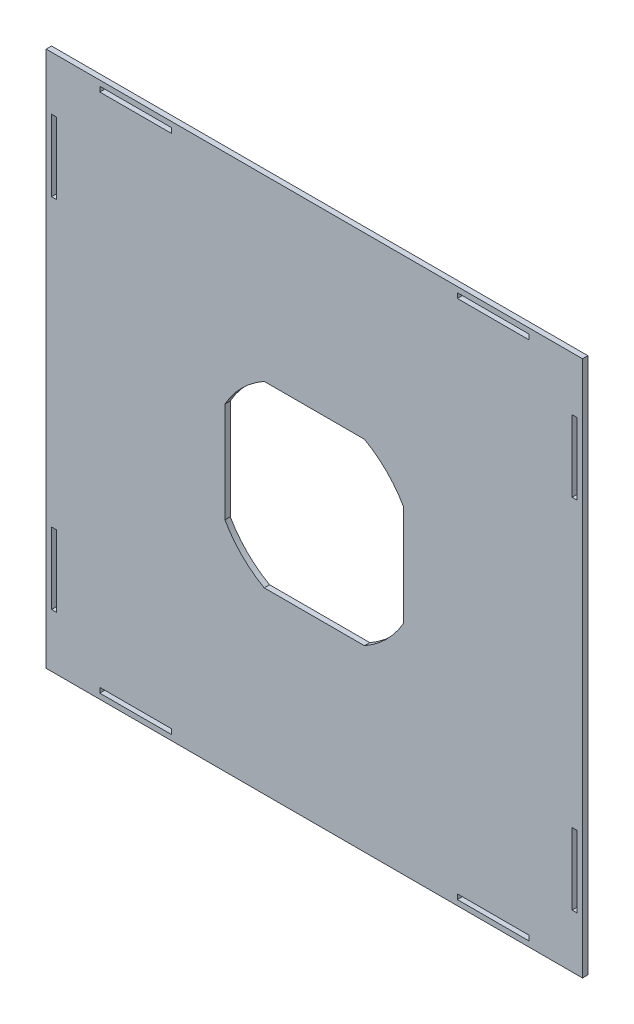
ISO-10303-21;
HEADER;
FILE_DESCRIPTION(('STEP AP214'),'2;1');
FILE_NAME('part.step','',(''),(''),'','','');
FILE_SCHEMA(('AUTOMOTIVE_DESIGN { 1 0 10303 214 1 1 1 1 }'));
ENDSEC;
DATA;
#1=APPLICATION_CONTEXT('core data for automotive mechanical design processes');
#2=APPLICATION_PROTOCOL_DEFINITION('international standard','automotive_design',2000,#1);
#3=PRODUCT_CONTEXT('',#1,'mechanical');
#4=PRODUCT('Part','Part','',(#3));
#5=PRODUCT_RELATED_PRODUCT_CATEGORY('part','',(#4));
#6=PRODUCT_DEFINITION_FORMATION('','',#4);
#7=PRODUCT_DEFINITION_CONTEXT('part definition',#1,'design');
#8=PRODUCT_DEFINITION('design','',#6,#7);
#9=PRODUCT_DEFINITION_SHAPE('','',#8);
#10=(LENGTH_UNIT() NAMED_UNIT(*) SI_UNIT(.MILLI.,.METRE.));
#11=(NAMED_UNIT(*) PLANE_ANGLE_UNIT() SI_UNIT($,.RADIAN.));
#12=(NAMED_UNIT(*) SI_UNIT($,.STERADIAN.) SOLID_ANGLE_UNIT());
#13=UNCERTAINTY_MEASURE_WITH_UNIT(LENGTH_MEASURE(1.E-05),#10,'distance_accuracy_value','');
#14=(GEOMETRIC_REPRESENTATION_CONTEXT(3) GLOBAL_UNCERTAINTY_ASSIGNED_CONTEXT((#13)) GLOBAL_UNIT_ASSIGNED_CONTEXT((#10,
#11,#12)) REPRESENTATION_CONTEXT('',''));
#15=CARTESIAN_POINT('',(0.,0.,0.));
#16=DIRECTION('',(0.,0.,1.));
#17=DIRECTION('',(1.,0.,0.));
#18=AXIS2_PLACEMENT_3D('',#15,#16,#17);
#19=CARTESIAN_POINT('',(0.,0.,3.));
#20=DIRECTION('',(0.,0.,-1.));
#21=DIRECTION('',(-1.,0.,0.));
#22=AXIS2_PLACEMENT_3D('',#19,#20,#21);
#23=PLANE('',#22);
#24=DIRECTION('',(-1.,0.,0.));
#25=VECTOR('',#24,1.);
#26=CARTESIAN_POINT('',(-28.0435023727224,50.0000000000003,3.));
#27=LINE('',#26,#25);
#28=CARTESIAN_POINT('',(28.0435023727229,50.,3.));
#29=VERTEX_POINT('',#28);
#30=CARTESIAN_POINT('',(-28.0435023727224,50.0000000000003,3.));
#31=VERTEX_POINT('',#30);
#32=EDGE_CURVE('E325',#29,#31,#27,.T.);
#33=ORIENTED_EDGE('',*,*,#32,.F.);
#34=CARTESIAN_POINT('',(0.,0.,3.));
#35=DIRECTION('',(0.,0.,1.));
#36=DIRECTION('',(-1.,0.,0.));
#37=AXIS2_PLACEMENT_3D('',#34,#35,#36);
#38=CIRCLE('',#37,57.327463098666);
#39=CARTESIAN_POINT('',(50.,28.0435023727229,3.));
#40=VERTEX_POINT('',#39);
#41=EDGE_CURVE('E48',#40,#29,#38,.T.);
#42=ORIENTED_EDGE('',*,*,#41,.F.);
#43=DIRECTION('',(0.,1.,0.));
#44=VECTOR('',#43,1.);
#45=CARTESIAN_POINT('',(49.9999999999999,-28.0435023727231,3.));
#46=LINE('',#45,#44);
#47=CARTESIAN_POINT('',(49.9999999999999,-28.0435023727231,3.));
#48=VERTEX_POINT('',#47);
#49=EDGE_CURVE('E346',#48,#40,#46,.T.);
#50=ORIENTED_EDGE('',*,*,#49,.F.);
#51=CARTESIAN_POINT('',(0.,0.,3.));
#52=DIRECTION('',(0.,0.,1.));
#53=DIRECTION('',(-1.,0.,0.));
#54=AXIS2_PLACEMENT_3D('',#51,#52,#53);
#55=CIRCLE('',#54,57.327463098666);
#56=CARTESIAN_POINT('',(28.0435023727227,-50.0000000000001,3.));
#57=VERTEX_POINT('',#56);
#58=EDGE_CURVE('E343',#57,#48,#55,.T.);
#59=ORIENTED_EDGE('',*,*,#58,.F.);
#60=DIRECTION('',(1.,0.,0.));
#61=VECTOR('',#60,1.);
#62=CARTESIAN_POINT('',(-28.0435023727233,-49.9999999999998,3.));
#63=LINE('',#62,#61);
#64=CARTESIAN_POINT('',(-28.0435023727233,-49.9999999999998,3.));
#65=VERTEX_POINT('',#64);
#66=EDGE_CURVE('E340',#65,#57,#63,.T.);
#67=ORIENTED_EDGE('',*,*,#66,.F.);
#68=CARTESIAN_POINT('',(0.,0.,3.));
#69=DIRECTION('',(0.,0.,1.));
#70=DIRECTION('',(-1.,0.,0.));
#71=AXIS2_PLACEMENT_3D('',#68,#69,#70);
#72=CIRCLE('',#71,57.327463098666);
#73=CARTESIAN_POINT('',(-50.0000000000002,-28.0435023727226,3.));
#74=VERTEX_POINT('',#73);
#75=EDGE_CURVE('E334',#74,#65,#72,.T.);
#76=ORIENTED_EDGE('',*,*,#75,.F.);
#77=DIRECTION('',(0.,-1.,0.));
#78=VECTOR('',#77,1.);
#79=CARTESIAN_POINT('',(-50.0000000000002,-28.0435023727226,3.));
#80=LINE('',#79,#78);
#81=CARTESIAN_POINT('',(-49.9999999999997,28.0435023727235,3.));
#82=VERTEX_POINT('',#81);
#83=EDGE_CURVE('E332',#82,#74,#80,.T.);
#84=ORIENTED_EDGE('',*,*,#83,.F.);
#85=CARTESIAN_POINT('',(0.,0.,3.));
#86=DIRECTION('',(0.,0.,1.));
#87=DIRECTION('',(-1.,0.,0.));
#88=AXIS2_PLACEMENT_3D('',#85,#86,#87);
#89=CIRCLE('',#88,57.327463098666);
#90=EDGE_CURVE('E316',#31,#82,#89,.T.);
#91=ORIENTED_EDGE('',*,*,#90,.F.);
#92=EDGE_LOOP('',(#33,#42,#50,#59,#67,#76,#84,#91));
#93=FACE_BOUND('',#92,.T.);
#94=DIRECTION('',(0.,-1.,0.));
#95=VECTOR('',#94,1.);
#96=CARTESIAN_POINT('',(144.199999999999,-120.000000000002,3.));
#97=LINE('',#96,#95);
#98=CARTESIAN_POINT('',(144.199999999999,-80.0000000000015,3.));
#99=VERTEX_POINT('',#98);
#100=CARTESIAN_POINT('',(144.199999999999,-120.000000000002,3.));
#101=VERTEX_POINT('',#100);
#102=EDGE_CURVE('E393',#99,#101,#97,.T.);
#103=ORIENTED_EDGE('',*,*,#102,.F.);
#104=DIRECTION('',(-1.,0.,0.));
#105=VECTOR('',#104,1.);
#106=CARTESIAN_POINT('',(144.199999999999,-80.0000000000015,3.));
#107=LINE('',#106,#105);
#108=CARTESIAN_POINT('',(146.999999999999,-80.0000000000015,3.));
#109=VERTEX_POINT('',#108);
#110=EDGE_CURVE('E401',#109,#99,#107,.T.);
#111=ORIENTED_EDGE('',*,*,#110,.F.);
#112=DIRECTION('',(0.,1.,0.));
#113=VECTOR('',#112,1.);
#114=CARTESIAN_POINT('',(146.999999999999,-120.000000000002,3.));
#115=LINE('',#114,#113);
#116=CARTESIAN_POINT('',(146.999999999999,-120.000000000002,3.));
#117=VERTEX_POINT('',#116);
#118=EDGE_CURVE('E398',#117,#109,#115,.T.);
#119=ORIENTED_EDGE('',*,*,#118,.F.);
#120=DIRECTION('',(1.,0.,0.));
#121=VECTOR('',#120,1.);
#122=CARTESIAN_POINT('',(144.199999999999,-120.000000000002,3.));
#123=LINE('',#122,#121);
#124=EDGE_CURVE('E395',#101,#117,#123,.T.);
#125=ORIENTED_EDGE('',*,*,#124,.F.);
#126=EDGE_LOOP('',(#103,#111,#119,#125));
#127=FACE_BOUND('',#126,.T.);
#128=DIRECTION('',(1.,0.,0.));
#129=VECTOR('',#128,1.);
#130=CARTESIAN_POINT('',(120.000000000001,144.199999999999,3.));
#131=LINE('',#130,#129);
#132=CARTESIAN_POINT('',(80.000000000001,144.199999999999,3.));
#133=VERTEX_POINT('',#132);
#134=CARTESIAN_POINT('',(120.000000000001,144.199999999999,3.));
#135=VERTEX_POINT('',#134);
#136=EDGE_CURVE('E455',#133,#135,#131,.T.);
#137=ORIENTED_EDGE('',*,*,#136,.F.);
#138=DIRECTION('',(0.,-1.,0.));
#139=VECTOR('',#138,1.);
#140=CARTESIAN_POINT('',(80.000000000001,144.199999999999,3.));
#141=LINE('',#140,#139);
#142=CARTESIAN_POINT('',(80.000000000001,146.999999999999,3.));
#143=VERTEX_POINT('',#142);
#144=EDGE_CURVE('E463',#143,#133,#141,.T.);
#145=ORIENTED_EDGE('',*,*,#144,.F.);
#146=DIRECTION('',(-1.,0.,0.));
#147=VECTOR('',#146,1.);
#148=CARTESIAN_POINT('',(120.000000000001,146.999999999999,3.));
#149=LINE('',#148,#147);
#150=CARTESIAN_POINT('',(120.000000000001,146.999999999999,3.));
#151=VERTEX_POINT('',#150);
#152=EDGE_CURVE('E460',#151,#143,#149,.T.);
#153=ORIENTED_EDGE('',*,*,#152,.F.);
#154=DIRECTION('',(0.,1.,0.));
#155=VECTOR('',#154,1.);
#156=CARTESIAN_POINT('',(120.000000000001,144.199999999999,3.));
#157=LINE('',#156,#155);
#158=EDGE_CURVE('E457',#135,#151,#157,.T.);
#159=ORIENTED_EDGE('',*,*,#158,.F.);
#160=EDGE_LOOP('',(#137,#145,#153,#159));
#161=FACE_BOUND('',#160,.T.);
#162=DIRECTION('',(0.,1.,0.));
#163=VECTOR('',#162,1.);
#164=CARTESIAN_POINT('',(-144.2,120.,3.));
#165=LINE('',#164,#163);
#166=CARTESIAN_POINT('',(-144.2,80.0000000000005,3.));
#167=VERTEX_POINT('',#166);
#168=CARTESIAN_POINT('',(-144.2,120.,3.));
#169=VERTEX_POINT('',#168);
#170=EDGE_CURVE('E517',#167,#169,#165,.T.);
#171=ORIENTED_EDGE('',*,*,#170,.F.);
#172=DIRECTION('',(1.,0.,0.));
#173=VECTOR('',#172,1.);
#174=CARTESIAN_POINT('',(-144.2,80.0000000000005,3.));
#175=LINE('',#174,#173);
#176=CARTESIAN_POINT('',(-147.,80.0000000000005,3.));
#177=VERTEX_POINT('',#176);
#178=EDGE_CURVE('E525',#177,#167,#175,.T.);
#179=ORIENTED_EDGE('',*,*,#178,.F.);
#180=DIRECTION('',(0.,-1.,0.));
#181=VECTOR('',#180,1.);
#182=CARTESIAN_POINT('',(-147.,120.,3.));
#183=LINE('',#182,#181);
#184=CARTESIAN_POINT('',(-147.,120.,3.));
#185=VERTEX_POINT('',#184);
#186=EDGE_CURVE('E522',#185,#177,#183,.T.);
#187=ORIENTED_EDGE('',*,*,#186,.F.);
#188=DIRECTION('',(-1.,0.,0.));
#189=VECTOR('',#188,1.);
#190=CARTESIAN_POINT('',(-144.2,120.,3.));
#191=LINE('',#190,#189);
#192=EDGE_CURVE('E519',#169,#185,#191,.T.);
#193=ORIENTED_EDGE('',*,*,#192,.F.);
#194=EDGE_LOOP('',(#171,#179,#187,#193));
#195=FACE_BOUND('',#194,.T.);
#196=DIRECTION('',(0.,-1.,0.));
#197=VECTOR('',#196,1.);
#198=CARTESIAN_POINT('',(-120.,-144.2,3.));
#199=LINE('',#198,#197);
#200=CARTESIAN_POINT('',(-120.,-144.2,3.));
#201=VERTEX_POINT('',#200);
#202=CARTESIAN_POINT('',(-120.,-147.,3.));
#203=VERTEX_POINT('',#202);
#204=EDGE_CURVE('E579',#201,#203,#199,.T.);
#205=ORIENTED_EDGE('',*,*,#204,.F.);
#206=DIRECTION('',(-1.,0.,0.));
#207=VECTOR('',#206,1.);
#208=CARTESIAN_POINT('',(-120.,-144.2,3.));
#209=LINE('',#208,#207);
#210=CARTESIAN_POINT('',(-80.,-144.2,3.));
#211=VERTEX_POINT('',#210);
#212=EDGE_CURVE('E587',#211,#201,#209,.T.);
#213=ORIENTED_EDGE('',*,*,#212,.F.);
#214=DIRECTION('',(0.,1.,0.));
#215=VECTOR('',#214,1.);
#216=CARTESIAN_POINT('',(-80.,-144.2,3.));
#217=LINE('',#216,#215);
#218=CARTESIAN_POINT('',(-80.,-147.,3.));
#219=VERTEX_POINT('',#218);
#220=EDGE_CURVE('E584',#219,#211,#217,.T.);
#221=ORIENTED_EDGE('',*,*,#220,.F.);
#222=DIRECTION('',(1.,0.,0.));
#223=VECTOR('',#222,1.);
#224=CARTESIAN_POINT('',(-120.,-147.,3.));
#225=LINE('',#224,#223);
#226=EDGE_CURVE('E581',#203,#219,#225,.T.);
#227=ORIENTED_EDGE('',*,*,#226,.F.);
#228=EDGE_LOOP('',(#205,#213,#221,#227));
#229=FACE_BOUND('',#228,.T.);
#230=DIRECTION('',(0.,1.,0.));
#231=VECTOR('',#230,1.);
#232=CARTESIAN_POINT('',(150.,-150.,3.));
#233=LINE('',#232,#231);
#234=CARTESIAN_POINT('',(150.,-150.,3.));
#235=VERTEX_POINT('',#234);
#236=CARTESIAN_POINT('',(150.,150.,3.));
#237=VERTEX_POINT('',#236);
#238=EDGE_CURVE('E610',#235,#237,#233,.T.);
#239=ORIENTED_EDGE('',*,*,#238,.T.);
#240=DIRECTION('',(-1.,0.,0.));
#241=VECTOR('',#240,1.);
#242=CARTESIAN_POINT('',(-150.,150.,3.));
#243=LINE('',#242,#241);
#244=CARTESIAN_POINT('',(-150.,150.,3.));
#245=VERTEX_POINT('',#244);
#246=EDGE_CURVE('E613',#237,#245,#243,.T.);
#247=ORIENTED_EDGE('',*,*,#246,.T.);
#248=DIRECTION('',(0.,-1.,0.));
#249=VECTOR('',#248,1.);
#250=CARTESIAN_POINT('',(-150.,-150.,3.));
#251=LINE('',#250,#249);
#252=CARTESIAN_POINT('',(-150.,-150.,3.));
#253=VERTEX_POINT('',#252);
#254=EDGE_CURVE('E616',#245,#253,#251,.T.);
#255=ORIENTED_EDGE('',*,*,#254,.T.);
#256=DIRECTION('',(1.,0.,0.));
#257=VECTOR('',#256,1.);
#258=CARTESIAN_POINT('',(-150.,-150.,3.));
#259=LINE('',#258,#257);
#260=EDGE_CURVE('E618',#253,#235,#259,.T.);
#261=ORIENTED_EDGE('',*,*,#260,.T.);
#262=EDGE_LOOP('',(#239,#247,#255,#261));
#263=FACE_BOUND('',#262,.T.);
#264=DIRECTION('',(0.,1.,0.));
#265=VECTOR('',#264,1.);
#266=CARTESIAN_POINT('',(120.,-144.2,3.));
#267=LINE('',#266,#265);
#268=CARTESIAN_POINT('',(120.,-147.,3.));
#269=VERTEX_POINT('',#268);
#270=CARTESIAN_POINT('',(120.,-144.2,3.));
#271=VERTEX_POINT('',#270);
#272=EDGE_CURVE('E548',#269,#271,#267,.T.);
#273=ORIENTED_EDGE('',*,*,#272,.F.);
#274=DIRECTION('',(1.,0.,0.));
#275=VECTOR('',#274,1.);
#276=CARTESIAN_POINT('',(120.,-147.,3.));
#277=LINE('',#276,#275);
#278=CARTESIAN_POINT('',(80.,-147.,3.));
#279=VERTEX_POINT('',#278);
#280=EDGE_CURVE('E556',#279,#269,#277,.T.);
#281=ORIENTED_EDGE('',*,*,#280,.F.);
#282=DIRECTION('',(0.,-1.,0.));
#283=VECTOR('',#282,1.);
#284=CARTESIAN_POINT('',(80.,-144.2,3.));
#285=LINE('',#284,#283);
#286=CARTESIAN_POINT('',(80.,-144.2,3.));
#287=VERTEX_POINT('',#286);
#288=EDGE_CURVE('E553',#287,#279,#285,.T.);
#289=ORIENTED_EDGE('',*,*,#288,.F.);
#290=DIRECTION('',(-1.,0.,0.));
#291=VECTOR('',#290,1.);
#292=CARTESIAN_POINT('',(120.,-144.2,3.));
#293=LINE('',#292,#291);
#294=EDGE_CURVE('E550',#271,#287,#293,.T.);
#295=ORIENTED_EDGE('',*,*,#294,.F.);
#296=EDGE_LOOP('',(#273,#281,#289,#295));
#297=FACE_BOUND('',#296,.T.);
#298=DIRECTION('',(1.,0.,0.));
#299=VECTOR('',#298,1.);
#300=CARTESIAN_POINT('',(-144.2,-120.,3.));
#301=LINE('',#300,#299);
#302=CARTESIAN_POINT('',(-147.,-120.,3.));
#303=VERTEX_POINT('',#302);
#304=CARTESIAN_POINT('',(-144.2,-120.,3.));
#305=VERTEX_POINT('',#304);
#306=EDGE_CURVE('E486',#303,#305,#301,.T.);
#307=ORIENTED_EDGE('',*,*,#306,.F.);
#308=DIRECTION('',(0.,-1.,0.));
#309=VECTOR('',#308,1.);
#310=CARTESIAN_POINT('',(-147.,-120.,3.));
#311=LINE('',#310,#309);
#312=CARTESIAN_POINT('',(-147.,-79.9999999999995,3.));
#313=VERTEX_POINT('',#312);
#314=EDGE_CURVE('E494',#313,#303,#311,.T.);
#315=ORIENTED_EDGE('',*,*,#314,.F.);
#316=DIRECTION('',(-1.,0.,0.));
#317=VECTOR('',#316,1.);
#318=CARTESIAN_POINT('',(-144.2,-79.9999999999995,3.));
#319=LINE('',#318,#317);
#320=CARTESIAN_POINT('',(-144.2,-79.9999999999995,3.));
#321=VERTEX_POINT('',#320);
#322=EDGE_CURVE('E491',#321,#313,#319,.T.);
#323=ORIENTED_EDGE('',*,*,#322,.F.);
#324=DIRECTION('',(0.,1.,0.));
#325=VECTOR('',#324,1.);
#326=CARTESIAN_POINT('',(-144.2,-120.,3.));
#327=LINE('',#326,#325);
#328=EDGE_CURVE('E488',#305,#321,#327,.T.);
#329=ORIENTED_EDGE('',*,*,#328,.F.);
#330=EDGE_LOOP('',(#307,#315,#323,#329));
#331=FACE_BOUND('',#330,.T.);
#332=DIRECTION('',(0.,-1.,0.));
#333=VECTOR('',#332,1.);
#334=CARTESIAN_POINT('',(-119.999999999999,144.200000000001,3.));
#335=LINE('',#334,#333);
#336=CARTESIAN_POINT('',(-119.999999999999,147.000000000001,3.));
#337=VERTEX_POINT('',#336);
#338=CARTESIAN_POINT('',(-119.999999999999,144.200000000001,3.));
#339=VERTEX_POINT('',#338);
#340=EDGE_CURVE('E424',#337,#339,#335,.T.);
#341=ORIENTED_EDGE('',*,*,#340,.F.);
#342=DIRECTION('',(-1.,0.,0.));
#343=VECTOR('',#342,1.);
#344=CARTESIAN_POINT('',(-119.999999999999,147.000000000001,3.));
#345=LINE('',#344,#343);
#346=CARTESIAN_POINT('',(-79.999999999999,147.000000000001,3.));
#347=VERTEX_POINT('',#346);
#348=EDGE_CURVE('E432',#347,#337,#345,.T.);
#349=ORIENTED_EDGE('',*,*,#348,.F.);
#350=DIRECTION('',(0.,1.,0.));
#351=VECTOR('',#350,1.);
#352=CARTESIAN_POINT('',(-79.999999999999,144.200000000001,3.));
#353=LINE('',#352,#351);
#354=CARTESIAN_POINT('',(-79.999999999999,144.200000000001,3.));
#355=VERTEX_POINT('',#354);
#356=EDGE_CURVE('E429',#355,#347,#353,.T.);
#357=ORIENTED_EDGE('',*,*,#356,.F.);
#358=DIRECTION('',(1.,0.,0.));
#359=VECTOR('',#358,1.);
#360=CARTESIAN_POINT('',(-119.999999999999,144.200000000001,3.));
#361=LINE('',#360,#359);
#362=EDGE_CURVE('E426',#339,#355,#361,.T.);
#363=ORIENTED_EDGE('',*,*,#362,.F.);
#364=EDGE_LOOP('',(#341,#349,#357,#363));
#365=FACE_BOUND('',#364,.T.);
#366=DIRECTION('',(-1.,0.,0.));
#367=VECTOR('',#366,1.);
#368=CARTESIAN_POINT('',(144.200000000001,119.999999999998,3.));
#369=LINE('',#368,#367);
#370=CARTESIAN_POINT('',(147.000000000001,119.999999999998,3.));
#371=VERTEX_POINT('',#370);
#372=CARTESIAN_POINT('',(144.200000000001,119.999999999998,3.));
#373=VERTEX_POINT('',#372);
#374=EDGE_CURVE('E362',#371,#373,#369,.T.);
#375=ORIENTED_EDGE('',*,*,#374,.F.);
#376=DIRECTION('',(0.,1.,0.));
#377=VECTOR('',#376,1.);
#378=CARTESIAN_POINT('',(147.000000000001,119.999999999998,3.));
#379=LINE('',#378,#377);
#380=CARTESIAN_POINT('',(147.000000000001,79.9999999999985,3.));
#381=VERTEX_POINT('',#380);
#382=EDGE_CURVE('E370',#381,#371,#379,.T.);
#383=ORIENTED_EDGE('',*,*,#382,.F.);
#384=DIRECTION('',(1.,0.,0.));
#385=VECTOR('',#384,1.);
#386=CARTESIAN_POINT('',(144.200000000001,79.9999999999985,3.));
#387=LINE('',#386,#385);
#388=CARTESIAN_POINT('',(144.200000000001,79.9999999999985,3.));
#389=VERTEX_POINT('',#388);
#390=EDGE_CURVE('E367',#389,#381,#387,.T.);
#391=ORIENTED_EDGE('',*,*,#390,.F.);
#392=DIRECTION('',(0.,-1.,0.));
#393=VECTOR('',#392,1.);
#394=CARTESIAN_POINT('',(144.200000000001,119.999999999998,3.));
#395=LINE('',#394,#393);
#396=EDGE_CURVE('E364',#373,#389,#395,.T.);
#397=ORIENTED_EDGE('',*,*,#396,.F.);
#398=EDGE_LOOP('',(#375,#383,#391,#397));
#399=FACE_BOUND('',#398,.T.);
#400=ADVANCED_FACE('F33',(#93,#127,#161,#195,#229,#263,#297,#331,#365,#399),#23,.F.);
#401=CARTESIAN_POINT('',(0.,0.,0.));
#402=DIRECTION('',(0.,0.,-1.));
#403=DIRECTION('',(-1.,0.,0.));
#404=AXIS2_PLACEMENT_3D('',#401,#402,#403);
#405=PLANE('',#404);
#406=CARTESIAN_POINT('',(0.,0.,0.));
#407=DIRECTION('',(0.,0.,-1.));
#408=DIRECTION('',(-1.,0.,0.));
#409=AXIS2_PLACEMENT_3D('',#406,#407,#408);
#410=CIRCLE('',#409,57.327463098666);
#411=CARTESIAN_POINT('',(28.0435023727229,50.,0.));
#412=VERTEX_POINT('',#411);
#413=CARTESIAN_POINT('',(50.,28.0435023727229,0.));
#414=VERTEX_POINT('',#413);
#415=EDGE_CURVE('E11',#412,#414,#410,.T.);
#416=ORIENTED_EDGE('',*,*,#415,.F.);
#417=DIRECTION('',(1.,0.,0.));
#418=VECTOR('',#417,1.);
#419=CARTESIAN_POINT('',(2.59804873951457E-13,50.0000000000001,0.));
#420=LINE('',#419,#418);
#421=CARTESIAN_POINT('',(-28.0435023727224,50.0000000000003,0.));
#422=VERTEX_POINT('',#421);
#423=EDGE_CURVE('E639',#422,#412,#420,.T.);
#424=ORIENTED_EDGE('',*,*,#423,.F.);
#425=CARTESIAN_POINT('',(0.,0.,0.));
#426=DIRECTION('',(0.,0.,-1.));
#427=DIRECTION('',(-1.,0.,0.));
#428=AXIS2_PLACEMENT_3D('',#425,#426,#427);
#429=CIRCLE('',#428,57.327463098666);
#430=CARTESIAN_POINT('',(-49.9999999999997,28.0435023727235,0.));
#431=VERTEX_POINT('',#430);
#432=EDGE_CURVE('E319',#431,#422,#429,.T.);
#433=ORIENTED_EDGE('',*,*,#432,.F.);
#434=DIRECTION('',(0.,1.,0.));
#435=VECTOR('',#434,1.);
#436=CARTESIAN_POINT('',(-50.,4.391939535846E-13,0.));
#437=LINE('',#436,#435);
#438=CARTESIAN_POINT('',(-50.0000000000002,-28.0435023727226,0.));
#439=VERTEX_POINT('',#438);
#440=EDGE_CURVE('E642',#439,#431,#437,.T.);
#441=ORIENTED_EDGE('',*,*,#440,.F.);
#442=CARTESIAN_POINT('',(0.,0.,0.));
#443=DIRECTION('',(0.,0.,-1.));
#444=DIRECTION('',(-1.,0.,0.));
#445=AXIS2_PLACEMENT_3D('',#442,#443,#444);
#446=CIRCLE('',#445,57.327463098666);
#447=CARTESIAN_POINT('',(-28.0435023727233,-49.9999999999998,0.));
#448=VERTEX_POINT('',#447);
#449=EDGE_CURVE('E644',#448,#439,#446,.T.);
#450=ORIENTED_EDGE('',*,*,#449,.F.);
#451=DIRECTION('',(-1.,0.,0.));
#452=VECTOR('',#451,1.);
#453=CARTESIAN_POINT('',(-2.59804873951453E-13,-50.,0.));
#454=LINE('',#453,#452);
#455=CARTESIAN_POINT('',(28.0435023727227,-50.0000000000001,0.));
#456=VERTEX_POINT('',#455);
#457=EDGE_CURVE('E646',#456,#448,#454,.T.);
#458=ORIENTED_EDGE('',*,*,#457,.F.);
#459=CARTESIAN_POINT('',(0.,0.,0.));
#460=DIRECTION('',(0.,0.,-1.));
#461=DIRECTION('',(-1.,0.,0.));
#462=AXIS2_PLACEMENT_3D('',#459,#460,#461);
#463=CIRCLE('',#462,57.327463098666);
#464=CARTESIAN_POINT('',(49.9999999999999,-28.0435023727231,0.));
#465=VERTEX_POINT('',#464);
#466=EDGE_CURVE('E648',#465,#456,#463,.T.);
#467=ORIENTED_EDGE('',*,*,#466,.F.);
#468=DIRECTION('',(0.,-1.,0.));
#469=VECTOR('',#468,1.);
#470=CARTESIAN_POINT('',(50.,0.,0.));
#471=LINE('',#470,#469);
#472=EDGE_CURVE('E41',#414,#465,#471,.T.);
#473=ORIENTED_EDGE('',*,*,#472,.F.);
#474=EDGE_LOOP('',(#416,#424,#433,#441,#450,#458,#467,#473));
#475=FACE_BOUND('',#474,.T.);
#476=DIRECTION('',(0.,1.,0.));
#477=VECTOR('',#476,1.);
#478=CARTESIAN_POINT('',(150.,-150.,0.));
#479=LINE('',#478,#477);
#480=CARTESIAN_POINT('',(150.,-150.,0.));
#481=VERTEX_POINT('',#480);
#482=CARTESIAN_POINT('',(150.,150.,0.));
#483=VERTEX_POINT('',#482);
#484=EDGE_CURVE('E609',#481,#483,#479,.T.);
#485=ORIENTED_EDGE('',*,*,#484,.F.);
#486=DIRECTION('',(1.,0.,0.));
#487=VECTOR('',#486,1.);
#488=CARTESIAN_POINT('',(-150.,-150.,0.));
#489=LINE('',#488,#487);
#490=CARTESIAN_POINT('',(-150.,-150.,0.));
#491=VERTEX_POINT('',#490);
#492=EDGE_CURVE('E614',#491,#481,#489,.T.);
#493=ORIENTED_EDGE('',*,*,#492,.F.);
#494=DIRECTION('',(0.,-1.,0.));
#495=VECTOR('',#494,1.);
#496=CARTESIAN_POINT('',(-150.,-150.,0.));
#497=LINE('',#496,#495);
#498=CARTESIAN_POINT('',(-150.,150.,0.));
#499=VERTEX_POINT('',#498);
#500=EDGE_CURVE('E625',#499,#491,#497,.T.);
#501=ORIENTED_EDGE('',*,*,#500,.F.);
#502=DIRECTION('',(-1.,0.,0.));
#503=VECTOR('',#502,1.);
#504=CARTESIAN_POINT('',(-150.,150.,0.));
#505=LINE('',#504,#503);
#506=EDGE_CURVE('E623',#483,#499,#505,.T.);
#507=ORIENTED_EDGE('',*,*,#506,.F.);
#508=EDGE_LOOP('',(#485,#493,#501,#507));
#509=FACE_BOUND('',#508,.T.);
#510=DIRECTION('',(-1.,0.,0.));
#511=VECTOR('',#510,1.);
#512=CARTESIAN_POINT('',(-120.,-144.2,0.));
#513=LINE('',#512,#511);
#514=CARTESIAN_POINT('',(-80.,-144.2,0.));
#515=VERTEX_POINT('',#514);
#516=CARTESIAN_POINT('',(-120.,-144.2,0.));
#517=VERTEX_POINT('',#516);
#518=EDGE_CURVE('E582',#515,#517,#513,.T.);
#519=ORIENTED_EDGE('',*,*,#518,.T.);
#520=DIRECTION('',(0.,-1.,0.));
#521=VECTOR('',#520,1.);
#522=CARTESIAN_POINT('',(-120.,-144.2,0.));
#523=LINE('',#522,#521);
#524=CARTESIAN_POINT('',(-120.,-147.,0.));
#525=VERTEX_POINT('',#524);
#526=EDGE_CURVE('E578',#517,#525,#523,.T.);
#527=ORIENTED_EDGE('',*,*,#526,.T.);
#528=DIRECTION('',(1.,0.,0.));
#529=VECTOR('',#528,1.);
#530=CARTESIAN_POINT('',(-120.,-147.,0.));
#531=LINE('',#530,#529);
#532=CARTESIAN_POINT('',(-80.,-147.,0.));
#533=VERTEX_POINT('',#532);
#534=EDGE_CURVE('E592',#525,#533,#531,.T.);
#535=ORIENTED_EDGE('',*,*,#534,.T.);
#536=DIRECTION('',(0.,1.,0.));
#537=VECTOR('',#536,1.);
#538=CARTESIAN_POINT('',(-80.,-144.2,0.));
#539=LINE('',#538,#537);
#540=EDGE_CURVE('E595',#533,#515,#539,.T.);
#541=ORIENTED_EDGE('',*,*,#540,.T.);
#542=EDGE_LOOP('',(#519,#527,#535,#541));
#543=FACE_BOUND('',#542,.T.);
#544=DIRECTION('',(1.,0.,0.));
#545=VECTOR('',#544,1.);
#546=CARTESIAN_POINT('',(120.,-147.,0.));
#547=LINE('',#546,#545);
#548=CARTESIAN_POINT('',(80.,-147.,0.));
#549=VERTEX_POINT('',#548);
#550=CARTESIAN_POINT('',(120.,-147.,0.));
#551=VERTEX_POINT('',#550);
#552=EDGE_CURVE('E551',#549,#551,#547,.T.);
#553=ORIENTED_EDGE('',*,*,#552,.T.);
#554=DIRECTION('',(0.,1.,0.));
#555=VECTOR('',#554,1.);
#556=CARTESIAN_POINT('',(120.,-144.2,0.));
#557=LINE('',#556,#555);
#558=CARTESIAN_POINT('',(120.,-144.2,0.));
#559=VERTEX_POINT('',#558);
#560=EDGE_CURVE('E547',#551,#559,#557,.T.);
#561=ORIENTED_EDGE('',*,*,#560,.T.);
#562=DIRECTION('',(-1.,0.,0.));
#563=VECTOR('',#562,1.);
#564=CARTESIAN_POINT('',(120.,-144.2,0.));
#565=LINE('',#564,#563);
#566=CARTESIAN_POINT('',(80.,-144.2,0.));
#567=VERTEX_POINT('',#566);
#568=EDGE_CURVE('E561',#559,#567,#565,.T.);
#569=ORIENTED_EDGE('',*,*,#568,.T.);
#570=DIRECTION('',(0.,-1.,0.));
#571=VECTOR('',#570,1.);
#572=CARTESIAN_POINT('',(80.,-144.2,0.));
#573=LINE('',#572,#571);
#574=EDGE_CURVE('E564',#567,#549,#573,.T.);
#575=ORIENTED_EDGE('',*,*,#574,.T.);
#576=EDGE_LOOP('',(#553,#561,#569,#575));
#577=FACE_BOUND('',#576,.T.);
#578=DIRECTION('',(1.,0.,0.));
#579=VECTOR('',#578,1.);
#580=CARTESIAN_POINT('',(-144.2,80.0000000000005,0.));
#581=LINE('',#580,#579);
#582=CARTESIAN_POINT('',(-147.,80.0000000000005,0.));
#583=VERTEX_POINT('',#582);
#584=CARTESIAN_POINT('',(-144.2,80.0000000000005,0.));
#585=VERTEX_POINT('',#584);
#586=EDGE_CURVE('E520',#583,#585,#581,.T.);
#587=ORIENTED_EDGE('',*,*,#586,.T.);
#588=DIRECTION('',(0.,1.,0.));
#589=VECTOR('',#588,1.);
#590=CARTESIAN_POINT('',(-144.2,120.,0.));
#591=LINE('',#590,#589);
#592=CARTESIAN_POINT('',(-144.2,120.,0.));
#593=VERTEX_POINT('',#592);
#594=EDGE_CURVE('E516',#585,#593,#591,.T.);
#595=ORIENTED_EDGE('',*,*,#594,.T.);
#596=DIRECTION('',(-1.,0.,0.));
#597=VECTOR('',#596,1.);
#598=CARTESIAN_POINT('',(-144.2,120.,0.));
#599=LINE('',#598,#597);
#600=CARTESIAN_POINT('',(-147.,120.,0.));
#601=VERTEX_POINT('',#600);
#602=EDGE_CURVE('E530',#593,#601,#599,.T.);
#603=ORIENTED_EDGE('',*,*,#602,.T.);
#604=DIRECTION('',(0.,-1.,0.));
#605=VECTOR('',#604,1.);
#606=CARTESIAN_POINT('',(-147.,120.,0.));
#607=LINE('',#606,#605);
#608=EDGE_CURVE('E533',#601,#583,#607,.T.);
#609=ORIENTED_EDGE('',*,*,#608,.T.);
#610=EDGE_LOOP('',(#587,#595,#603,#609));
#611=FACE_BOUND('',#610,.T.);
#612=DIRECTION('',(0.,-1.,0.));
#613=VECTOR('',#612,1.);
#614=CARTESIAN_POINT('',(-147.,-120.,0.));
#615=LINE('',#614,#613);
#616=CARTESIAN_POINT('',(-147.,-79.9999999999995,0.));
#617=VERTEX_POINT('',#616);
#618=CARTESIAN_POINT('',(-147.,-120.,0.));
#619=VERTEX_POINT('',#618);
#620=EDGE_CURVE('E489',#617,#619,#615,.T.);
#621=ORIENTED_EDGE('',*,*,#620,.T.);
#622=DIRECTION('',(1.,0.,0.));
#623=VECTOR('',#622,1.);
#624=CARTESIAN_POINT('',(-144.2,-120.,0.));
#625=LINE('',#624,#623);
#626=CARTESIAN_POINT('',(-144.2,-120.,0.));
#627=VERTEX_POINT('',#626);
#628=EDGE_CURVE('E485',#619,#627,#625,.T.);
#629=ORIENTED_EDGE('',*,*,#628,.T.);
#630=DIRECTION('',(0.,1.,0.));
#631=VECTOR('',#630,1.);
#632=CARTESIAN_POINT('',(-144.2,-120.,0.));
#633=LINE('',#632,#631);
#634=CARTESIAN_POINT('',(-144.2,-79.9999999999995,0.));
#635=VERTEX_POINT('',#634);
#636=EDGE_CURVE('E499',#627,#635,#633,.T.);
#637=ORIENTED_EDGE('',*,*,#636,.T.);
#638=DIRECTION('',(-1.,0.,0.));
#639=VECTOR('',#638,1.);
#640=CARTESIAN_POINT('',(-144.2,-79.9999999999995,0.));
#641=LINE('',#640,#639);
#642=EDGE_CURVE('E502',#635,#617,#641,.T.);
#643=ORIENTED_EDGE('',*,*,#642,.T.);
#644=EDGE_LOOP('',(#621,#629,#637,#643));
#645=FACE_BOUND('',#644,.T.);
#646=DIRECTION('',(0.,-1.,0.));
#647=VECTOR('',#646,1.);
#648=CARTESIAN_POINT('',(80.000000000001,144.199999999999,0.));
#649=LINE('',#648,#647);
#650=CARTESIAN_POINT('',(80.000000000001,146.999999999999,0.));
#651=VERTEX_POINT('',#650);
#652=CARTESIAN_POINT('',(80.000000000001,144.199999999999,0.));
#653=VERTEX_POINT('',#652);
#654=EDGE_CURVE('E458',#651,#653,#649,.T.);
#655=ORIENTED_EDGE('',*,*,#654,.T.);
#656=DIRECTION('',(1.,0.,0.));
#657=VECTOR('',#656,1.);
#658=CARTESIAN_POINT('',(120.000000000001,144.199999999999,0.));
#659=LINE('',#658,#657);
#660=CARTESIAN_POINT('',(120.000000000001,144.199999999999,0.));
#661=VERTEX_POINT('',#660);
#662=EDGE_CURVE('E454',#653,#661,#659,.T.);
#663=ORIENTED_EDGE('',*,*,#662,.T.);
#664=DIRECTION('',(0.,1.,0.));
#665=VECTOR('',#664,1.);
#666=CARTESIAN_POINT('',(120.000000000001,144.199999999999,0.));
#667=LINE('',#666,#665);
#668=CARTESIAN_POINT('',(120.000000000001,146.999999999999,0.));
#669=VERTEX_POINT('',#668);
#670=EDGE_CURVE('E468',#661,#669,#667,.T.);
#671=ORIENTED_EDGE('',*,*,#670,.T.);
#672=DIRECTION('',(-1.,0.,0.));
#673=VECTOR('',#672,1.);
#674=CARTESIAN_POINT('',(120.000000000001,146.999999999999,0.));
#675=LINE('',#674,#673);
#676=EDGE_CURVE('E471',#669,#651,#675,.T.);
#677=ORIENTED_EDGE('',*,*,#676,.T.);
#678=EDGE_LOOP('',(#655,#663,#671,#677));
#679=FACE_BOUND('',#678,.T.);
#680=DIRECTION('',(-1.,0.,0.));
#681=VECTOR('',#680,1.);
#682=CARTESIAN_POINT('',(-119.999999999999,147.000000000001,0.));
#683=LINE('',#682,#681);
#684=CARTESIAN_POINT('',(-79.999999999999,147.000000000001,0.));
#685=VERTEX_POINT('',#684);
#686=CARTESIAN_POINT('',(-119.999999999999,147.000000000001,0.));
#687=VERTEX_POINT('',#686);
#688=EDGE_CURVE('E427',#685,#687,#683,.T.);
#689=ORIENTED_EDGE('',*,*,#688,.T.);
#690=DIRECTION('',(0.,-1.,0.));
#691=VECTOR('',#690,1.);
#692=CARTESIAN_POINT('',(-119.999999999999,144.200000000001,0.));
#693=LINE('',#692,#691);
#694=CARTESIAN_POINT('',(-119.999999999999,144.200000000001,0.));
#695=VERTEX_POINT('',#694);
#696=EDGE_CURVE('E423',#687,#695,#693,.T.);
#697=ORIENTED_EDGE('',*,*,#696,.T.);
#698=DIRECTION('',(1.,0.,0.));
#699=VECTOR('',#698,1.);
#700=CARTESIAN_POINT('',(-119.999999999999,144.200000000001,0.));
#701=LINE('',#700,#699);
#702=CARTESIAN_POINT('',(-79.999999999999,144.200000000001,0.));
#703=VERTEX_POINT('',#702);
#704=EDGE_CURVE('E437',#695,#703,#701,.T.);
#705=ORIENTED_EDGE('',*,*,#704,.T.);
#706=DIRECTION('',(0.,1.,0.));
#707=VECTOR('',#706,1.);
#708=CARTESIAN_POINT('',(-79.999999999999,144.200000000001,0.));
#709=LINE('',#708,#707);
#710=EDGE_CURVE('E440',#703,#685,#709,.T.);
#711=ORIENTED_EDGE('',*,*,#710,.T.);
#712=EDGE_LOOP('',(#689,#697,#705,#711));
#713=FACE_BOUND('',#712,.T.);
#714=DIRECTION('',(-1.,0.,0.));
#715=VECTOR('',#714,1.);
#716=CARTESIAN_POINT('',(144.199999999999,-80.0000000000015,0.));
#717=LINE('',#716,#715);
#718=CARTESIAN_POINT('',(146.999999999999,-80.0000000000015,0.));
#719=VERTEX_POINT('',#718);
#720=CARTESIAN_POINT('',(144.199999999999,-80.0000000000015,0.));
#721=VERTEX_POINT('',#720);
#722=EDGE_CURVE('E396',#719,#721,#717,.T.);
#723=ORIENTED_EDGE('',*,*,#722,.T.);
#724=DIRECTION('',(0.,-1.,0.));
#725=VECTOR('',#724,1.);
#726=CARTESIAN_POINT('',(144.199999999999,-120.000000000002,0.));
#727=LINE('',#726,#725);
#728=CARTESIAN_POINT('',(144.199999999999,-120.000000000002,0.));
#729=VERTEX_POINT('',#728);
#730=EDGE_CURVE('E392',#721,#729,#727,.T.);
#731=ORIENTED_EDGE('',*,*,#730,.T.);
#732=DIRECTION('',(1.,0.,0.));
#733=VECTOR('',#732,1.);
#734=CARTESIAN_POINT('',(144.199999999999,-120.000000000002,0.));
#735=LINE('',#734,#733);
#736=CARTESIAN_POINT('',(146.999999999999,-120.000000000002,0.));
#737=VERTEX_POINT('',#736);
#738=EDGE_CURVE('E406',#729,#737,#735,.T.);
#739=ORIENTED_EDGE('',*,*,#738,.T.);
#740=DIRECTION('',(0.,1.,0.));
#741=VECTOR('',#740,1.);
#742=CARTESIAN_POINT('',(146.999999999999,-120.000000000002,0.));
#743=LINE('',#742,#741);
#744=EDGE_CURVE('E409',#737,#719,#743,.T.);
#745=ORIENTED_EDGE('',*,*,#744,.T.);
#746=EDGE_LOOP('',(#723,#731,#739,#745));
#747=FACE_BOUND('',#746,.T.);
#748=DIRECTION('',(0.,1.,0.));
#749=VECTOR('',#748,1.);
#750=CARTESIAN_POINT('',(147.000000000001,119.999999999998,0.));
#751=LINE('',#750,#749);
#752=CARTESIAN_POINT('',(147.000000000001,79.9999999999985,0.));
#753=VERTEX_POINT('',#752);
#754=CARTESIAN_POINT('',(147.000000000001,119.999999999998,0.));
#755=VERTEX_POINT('',#754);
#756=EDGE_CURVE('E365',#753,#755,#751,.T.);
#757=ORIENTED_EDGE('',*,*,#756,.T.);
#758=DIRECTION('',(-1.,0.,0.));
#759=VECTOR('',#758,1.);
#760=CARTESIAN_POINT('',(144.200000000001,119.999999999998,0.));
#761=LINE('',#760,#759);
#762=CARTESIAN_POINT('',(144.200000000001,119.999999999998,0.));
#763=VERTEX_POINT('',#762);
#764=EDGE_CURVE('E351',#755,#763,#761,.T.);
#765=ORIENTED_EDGE('',*,*,#764,.T.);
#766=DIRECTION('',(0.,-1.,0.));
#767=VECTOR('',#766,1.);
#768=CARTESIAN_POINT('',(144.200000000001,119.999999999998,0.));
#769=LINE('',#768,#767);
#770=CARTESIAN_POINT('',(144.200000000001,79.9999999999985,0.));
#771=VERTEX_POINT('',#770);
#772=EDGE_CURVE('E375',#763,#771,#769,.T.);
#773=ORIENTED_EDGE('',*,*,#772,.T.);
#774=DIRECTION('',(1.,0.,0.));
#775=VECTOR('',#774,1.);
#776=CARTESIAN_POINT('',(144.200000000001,79.9999999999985,0.));
#777=LINE('',#776,#775);
#778=EDGE_CURVE('E378',#771,#753,#777,.T.);
#779=ORIENTED_EDGE('',*,*,#778,.T.);
#780=EDGE_LOOP('',(#757,#765,#773,#779));
#781=FACE_BOUND('',#780,.T.);
#782=ADVANCED_FACE('F663',(#475,#509,#543,#577,#611,#645,#679,#713,#747,#781),#405,.T.);
#783=CARTESIAN_POINT('',(150.,-150.,3.));
#784=DIRECTION('',(-1.,0.,0.));
#785=DIRECTION('',(0.,0.,1.));
#786=AXIS2_PLACEMENT_3D('',#783,#784,#785);
#787=PLANE('',#786);
#788=ORIENTED_EDGE('',*,*,#484,.T.);
#789=DIRECTION('',(0.,0.,-1.));
#790=VECTOR('',#789,1.);
#791=CARTESIAN_POINT('',(150.,150.,3.));
#792=LINE('',#791,#790);
#793=EDGE_CURVE('E636',#237,#483,#792,.T.);
#794=ORIENTED_EDGE('',*,*,#793,.F.);
#795=ORIENTED_EDGE('',*,*,#238,.F.);
#796=DIRECTION('',(0.,0.,-1.));
#797=VECTOR('',#796,1.);
#798=CARTESIAN_POINT('',(150.,-150.,3.));
#799=LINE('',#798,#797);
#800=EDGE_CURVE('E620',#235,#481,#799,.T.);
#801=ORIENTED_EDGE('',*,*,#800,.T.);
#802=EDGE_LOOP('',(#788,#794,#795,#801));
#803=FACE_BOUND('',#802,.T.);
#804=ADVANCED_FACE('F35',(#803),#787,.F.);
#805=CARTESIAN_POINT('',(-150.,150.,3.));
#806=DIRECTION('',(0.,-1.,0.));
#807=DIRECTION('',(0.,0.,-1.));
#808=AXIS2_PLACEMENT_3D('',#805,#806,#807);
#809=PLANE('',#808);
#810=ORIENTED_EDGE('',*,*,#506,.T.);
#811=DIRECTION('',(0.,0.,-1.));
#812=VECTOR('',#811,1.);
#813=CARTESIAN_POINT('',(-150.,150.,3.));
#814=LINE('',#813,#812);
#815=EDGE_CURVE('E633',#245,#499,#814,.T.);
#816=ORIENTED_EDGE('',*,*,#815,.F.);
#817=ORIENTED_EDGE('',*,*,#246,.F.);
#818=ORIENTED_EDGE('',*,*,#793,.T.);
#819=EDGE_LOOP('',(#810,#816,#817,#818));
#820=FACE_BOUND('',#819,.T.);
#821=ADVANCED_FACE('F706',(#820),#809,.F.);
#822=CARTESIAN_POINT('',(-150.,-150.,3.));
#823=DIRECTION('',(1.,0.,0.));
#824=DIRECTION('',(0.,0.,-1.));
#825=AXIS2_PLACEMENT_3D('',#822,#823,#824);
#826=PLANE('',#825);
#827=ORIENTED_EDGE('',*,*,#500,.T.);
#828=DIRECTION('',(0.,0.,-1.));
#829=VECTOR('',#828,1.);
#830=CARTESIAN_POINT('',(-150.,-150.,3.));
#831=LINE('',#830,#829);
#832=EDGE_CURVE('E630',#253,#491,#831,.T.);
#833=ORIENTED_EDGE('',*,*,#832,.F.);
#834=ORIENTED_EDGE('',*,*,#254,.F.);
#835=ORIENTED_EDGE('',*,*,#815,.T.);
#836=EDGE_LOOP('',(#827,#833,#834,#835));
#837=FACE_BOUND('',#836,.T.);
#838=ADVANCED_FACE('F703',(#837),#826,.F.);
#839=CARTESIAN_POINT('',(-150.,-150.,3.));
#840=DIRECTION('',(0.,1.,0.));
#841=DIRECTION('',(0.,0.,1.));
#842=AXIS2_PLACEMENT_3D('',#839,#840,#841);
#843=PLANE('',#842);
#844=ORIENTED_EDGE('',*,*,#492,.T.);
#845=ORIENTED_EDGE('',*,*,#800,.F.);
#846=ORIENTED_EDGE('',*,*,#260,.F.);
#847=ORIENTED_EDGE('',*,*,#832,.T.);
#848=EDGE_LOOP('',(#844,#845,#846,#847));
#849=FACE_BOUND('',#848,.T.);
#850=ADVANCED_FACE('F700',(#849),#843,.F.);
#851=CARTESIAN_POINT('',(-120.,-144.2,3.));
#852=DIRECTION('',(1.,0.,0.));
#853=DIRECTION('',(0.,0.,-1.));
#854=AXIS2_PLACEMENT_3D('',#851,#852,#853);
#855=PLANE('',#854);
#856=ORIENTED_EDGE('',*,*,#526,.F.);
#857=DIRECTION('',(0.,0.,-1.));
#858=VECTOR('',#857,1.);
#859=CARTESIAN_POINT('',(-120.,-144.2,3.));
#860=LINE('',#859,#858);
#861=EDGE_CURVE('E589',#201,#517,#860,.T.);
#862=ORIENTED_EDGE('',*,*,#861,.F.);
#863=ORIENTED_EDGE('',*,*,#204,.T.);
#864=DIRECTION('',(0.,0.,-1.));
#865=VECTOR('',#864,1.);
#866=CARTESIAN_POINT('',(-120.,-147.,3.));
#867=LINE('',#866,#865);
#868=EDGE_CURVE('E606',#203,#525,#867,.T.);
#869=ORIENTED_EDGE('',*,*,#868,.T.);
#870=EDGE_LOOP('',(#856,#862,#863,#869));
#871=FACE_BOUND('',#870,.T.);
#872=ADVANCED_FACE('F697',(#871),#855,.T.);
#873=CARTESIAN_POINT('',(-120.,-147.,3.));
#874=DIRECTION('',(0.,1.,0.));
#875=DIRECTION('',(0.,0.,1.));
#876=AXIS2_PLACEMENT_3D('',#873,#874,#875);
#877=PLANE('',#876);
#878=ORIENTED_EDGE('',*,*,#534,.F.);
#879=ORIENTED_EDGE('',*,*,#868,.F.);
#880=ORIENTED_EDGE('',*,*,#226,.T.);
#881=DIRECTION('',(0.,0.,-1.));
#882=VECTOR('',#881,1.);
#883=CARTESIAN_POINT('',(-80.,-147.,3.));
#884=LINE('',#883,#882);
#885=EDGE_CURVE('E604',#219,#533,#884,.T.);
#886=ORIENTED_EDGE('',*,*,#885,.T.);
#887=EDGE_LOOP('',(#878,#879,#880,#886));
#888=FACE_BOUND('',#887,.T.);
#889=ADVANCED_FACE('F865',(#888),#877,.T.);
#890=CARTESIAN_POINT('',(-80.,-144.2,3.));
#891=DIRECTION('',(-1.,0.,0.));
#892=DIRECTION('',(0.,0.,1.));
#893=AXIS2_PLACEMENT_3D('',#890,#891,#892);
#894=PLANE('',#893);
#895=ORIENTED_EDGE('',*,*,#540,.F.);
#896=ORIENTED_EDGE('',*,*,#885,.F.);
#897=ORIENTED_EDGE('',*,*,#220,.T.);
#898=DIRECTION('',(0.,0.,-1.));
#899=VECTOR('',#898,1.);
#900=CARTESIAN_POINT('',(-80.,-144.2,3.));
#901=LINE('',#900,#899);
#902=EDGE_CURVE('E602',#211,#515,#901,.T.);
#903=ORIENTED_EDGE('',*,*,#902,.T.);
#904=EDGE_LOOP('',(#895,#896,#897,#903));
#905=FACE_BOUND('',#904,.T.);
#906=ADVANCED_FACE('F862',(#905),#894,.T.);
#907=CARTESIAN_POINT('',(-120.,-144.2,3.));
#908=DIRECTION('',(0.,-1.,0.));
#909=DIRECTION('',(0.,0.,-1.));
#910=AXIS2_PLACEMENT_3D('',#907,#908,#909);
#911=PLANE('',#910);
#912=ORIENTED_EDGE('',*,*,#518,.F.);
#913=ORIENTED_EDGE('',*,*,#902,.F.);
#914=ORIENTED_EDGE('',*,*,#212,.T.);
#915=ORIENTED_EDGE('',*,*,#861,.T.);
#916=EDGE_LOOP('',(#912,#913,#914,#915));
#917=FACE_BOUND('',#916,.T.);
#918=ADVANCED_FACE('F858',(#917),#911,.T.);
#919=CARTESIAN_POINT('',(120.,-144.2,3.));
#920=DIRECTION('',(-1.,0.,0.));
#921=DIRECTION('',(0.,0.,1.));
#922=AXIS2_PLACEMENT_3D('',#919,#920,#921);
#923=PLANE('',#922);
#924=ORIENTED_EDGE('',*,*,#560,.F.);
#925=DIRECTION('',(0.,0.,-1.));
#926=VECTOR('',#925,1.);
#927=CARTESIAN_POINT('',(120.,-147.,3.));
#928=LINE('',#927,#926);
#929=EDGE_CURVE('E558',#269,#551,#928,.T.);
#930=ORIENTED_EDGE('',*,*,#929,.F.);
#931=ORIENTED_EDGE('',*,*,#272,.T.);
#932=DIRECTION('',(0.,0.,-1.));
#933=VECTOR('',#932,1.);
#934=CARTESIAN_POINT('',(120.,-144.2,3.));
#935=LINE('',#934,#933);
#936=EDGE_CURVE('E575',#271,#559,#935,.T.);
#937=ORIENTED_EDGE('',*,*,#936,.T.);
#938=EDGE_LOOP('',(#924,#930,#931,#937));
#939=FACE_BOUND('',#938,.T.);
#940=ADVANCED_FACE('F854',(#939),#923,.T.);
#941=CARTESIAN_POINT('',(120.,-144.2,3.));
#942=DIRECTION('',(0.,-1.,0.));
#943=DIRECTION('',(0.,0.,-1.));
#944=AXIS2_PLACEMENT_3D('',#941,#942,#943);
#945=PLANE('',#944);
#946=ORIENTED_EDGE('',*,*,#568,.F.);
#947=ORIENTED_EDGE('',*,*,#936,.F.);
#948=ORIENTED_EDGE('',*,*,#294,.T.);
#949=DIRECTION('',(0.,0.,-1.));
#950=VECTOR('',#949,1.);
#951=CARTESIAN_POINT('',(80.,-144.2,3.));
#952=LINE('',#951,#950);
#953=EDGE_CURVE('E573',#287,#567,#952,.T.);
#954=ORIENTED_EDGE('',*,*,#953,.T.);
#955=EDGE_LOOP('',(#946,#947,#948,#954));
#956=FACE_BOUND('',#955,.T.);
#957=ADVANCED_FACE('F850',(#956),#945,.T.);
#958=CARTESIAN_POINT('',(80.,-144.2,3.));
#959=DIRECTION('',(1.,0.,0.));
#960=DIRECTION('',(0.,0.,-1.));
#961=AXIS2_PLACEMENT_3D('',#958,#959,#960);
#962=PLANE('',#961);
#963=ORIENTED_EDGE('',*,*,#574,.F.);
#964=ORIENTED_EDGE('',*,*,#953,.F.);
#965=ORIENTED_EDGE('',*,*,#288,.T.);
#966=DIRECTION('',(0.,0.,-1.));
#967=VECTOR('',#966,1.);
#968=CARTESIAN_POINT('',(80.,-147.,3.));
#969=LINE('',#968,#967);
#970=EDGE_CURVE('E571',#279,#549,#969,.T.);
#971=ORIENTED_EDGE('',*,*,#970,.T.);
#972=EDGE_LOOP('',(#963,#964,#965,#971));
#973=FACE_BOUND('',#972,.T.);
#974=ADVANCED_FACE('F846',(#973),#962,.T.);
#975=CARTESIAN_POINT('',(120.,-147.,3.));
#976=DIRECTION('',(0.,1.,0.));
#977=DIRECTION('',(0.,0.,1.));
#978=AXIS2_PLACEMENT_3D('',#975,#976,#977);
#979=PLANE('',#978);
#980=ORIENTED_EDGE('',*,*,#552,.F.);
#981=ORIENTED_EDGE('',*,*,#970,.F.);
#982=ORIENTED_EDGE('',*,*,#280,.T.);
#983=ORIENTED_EDGE('',*,*,#929,.T.);
#984=EDGE_LOOP('',(#980,#981,#982,#983));
#985=FACE_BOUND('',#984,.T.);
#986=ADVANCED_FACE('F842',(#985),#979,.T.);
#987=CARTESIAN_POINT('',(-144.2,120.,3.));
#988=DIRECTION('',(-1.,0.,0.));
#989=DIRECTION('',(0.,-1.,0.));
#990=AXIS2_PLACEMENT_3D('',#987,#988,#989);
#991=PLANE('',#990);
#992=ORIENTED_EDGE('',*,*,#594,.F.);
#993=DIRECTION('',(0.,0.,-1.));
#994=VECTOR('',#993,1.);
#995=CARTESIAN_POINT('',(-144.2,80.0000000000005,3.));
#996=LINE('',#995,#994);
#997=EDGE_CURVE('E527',#167,#585,#996,.T.);
#998=ORIENTED_EDGE('',*,*,#997,.F.);
#999=ORIENTED_EDGE('',*,*,#170,.T.);
#1000=DIRECTION('',(0.,0.,-1.));
#1001=VECTOR('',#1000,1.);
#1002=CARTESIAN_POINT('',(-144.2,120.,3.));
#1003=LINE('',#1002,#1001);
#1004=EDGE_CURVE('E544',#169,#593,#1003,.T.);
#1005=ORIENTED_EDGE('',*,*,#1004,.T.);
#1006=EDGE_LOOP('',(#992,#998,#999,#1005));
#1007=FACE_BOUND('',#1006,.T.);
#1008=ADVANCED_FACE('F838',(#1007),#991,.T.);
#1009=CARTESIAN_POINT('',(-144.2,120.,3.));
#1010=DIRECTION('',(0.,-1.,0.));
#1011=DIRECTION('',(1.,0.,0.));
#1012=AXIS2_PLACEMENT_3D('',#1009,#1010,#1011);
#1013=PLANE('',#1012);
#1014=ORIENTED_EDGE('',*,*,#602,.F.);
#1015=ORIENTED_EDGE('',*,*,#1004,.F.);
#1016=ORIENTED_EDGE('',*,*,#192,.T.);
#1017=DIRECTION('',(0.,0.,-1.));
#1018=VECTOR('',#1017,1.);
#1019=CARTESIAN_POINT('',(-147.,120.,3.));
#1020=LINE('',#1019,#1018);
#1021=EDGE_CURVE('E542',#185,#601,#1020,.T.);
#1022=ORIENTED_EDGE('',*,*,#1021,.T.);
#1023=EDGE_LOOP('',(#1014,#1015,#1016,#1022));
#1024=FACE_BOUND('',#1023,.T.);
#1025=ADVANCED_FACE('F834',(#1024),#1013,.T.);
#1026=CARTESIAN_POINT('',(-147.,120.,3.));
#1027=DIRECTION('',(1.,0.,0.));
#1028=DIRECTION('',(0.,1.,0.));
#1029=AXIS2_PLACEMENT_3D('',#1026,#1027,#1028);
#1030=PLANE('',#1029);
#1031=ORIENTED_EDGE('',*,*,#608,.F.);
#1032=ORIENTED_EDGE('',*,*,#1021,.F.);
#1033=ORIENTED_EDGE('',*,*,#186,.T.);
#1034=DIRECTION('',(0.,0.,-1.));
#1035=VECTOR('',#1034,1.);
#1036=CARTESIAN_POINT('',(-147.,80.0000000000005,3.));
#1037=LINE('',#1036,#1035);
#1038=EDGE_CURVE('E540',#177,#583,#1037,.T.);
#1039=ORIENTED_EDGE('',*,*,#1038,.T.);
#1040=EDGE_LOOP('',(#1031,#1032,#1033,#1039));
#1041=FACE_BOUND('',#1040,.T.);
#1042=ADVANCED_FACE('F830',(#1041),#1030,.T.);
#1043=CARTESIAN_POINT('',(-144.2,80.0000000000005,3.));
#1044=DIRECTION('',(0.,1.,0.));
#1045=DIRECTION('',(-1.,0.,0.));
#1046=AXIS2_PLACEMENT_3D('',#1043,#1044,#1045);
#1047=PLANE('',#1046);
#1048=ORIENTED_EDGE('',*,*,#586,.F.);
#1049=ORIENTED_EDGE('',*,*,#1038,.F.);
#1050=ORIENTED_EDGE('',*,*,#178,.T.);
#1051=ORIENTED_EDGE('',*,*,#997,.T.);
#1052=EDGE_LOOP('',(#1048,#1049,#1050,#1051));
#1053=FACE_BOUND('',#1052,.T.);
#1054=ADVANCED_FACE('F826',(#1053),#1047,.T.);
#1055=CARTESIAN_POINT('',(-144.2,-120.,3.));
#1056=DIRECTION('',(0.,1.,0.));
#1057=DIRECTION('',(-1.,0.,0.));
#1058=AXIS2_PLACEMENT_3D('',#1055,#1056,#1057);
#1059=PLANE('',#1058);
#1060=ORIENTED_EDGE('',*,*,#628,.F.);
#1061=DIRECTION('',(0.,0.,-1.));
#1062=VECTOR('',#1061,1.);
#1063=CARTESIAN_POINT('',(-147.,-120.,3.));
#1064=LINE('',#1063,#1062);
#1065=EDGE_CURVE('E496',#303,#619,#1064,.T.);
#1066=ORIENTED_EDGE('',*,*,#1065,.F.);
#1067=ORIENTED_EDGE('',*,*,#306,.T.);
#1068=DIRECTION('',(0.,0.,-1.));
#1069=VECTOR('',#1068,1.);
#1070=CARTESIAN_POINT('',(-144.2,-120.,3.));
#1071=LINE('',#1070,#1069);
#1072=EDGE_CURVE('E513',#305,#627,#1071,.T.);
#1073=ORIENTED_EDGE('',*,*,#1072,.T.);
#1074=EDGE_LOOP('',(#1060,#1066,#1067,#1073));
#1075=FACE_BOUND('',#1074,.T.);
#1076=ADVANCED_FACE('F822',(#1075),#1059,.T.);
#1077=CARTESIAN_POINT('',(-144.2,-120.,3.));
#1078=DIRECTION('',(-1.,0.,0.));
#1079=DIRECTION('',(0.,-1.,0.));
#1080=AXIS2_PLACEMENT_3D('',#1077,#1078,#1079);
#1081=PLANE('',#1080);
#1082=ORIENTED_EDGE('',*,*,#636,.F.);
#1083=ORIENTED_EDGE('',*,*,#1072,.F.);
#1084=ORIENTED_EDGE('',*,*,#328,.T.);
#1085=DIRECTION('',(0.,0.,-1.));
#1086=VECTOR('',#1085,1.);
#1087=CARTESIAN_POINT('',(-144.2,-79.9999999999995,3.));
#1088=LINE('',#1087,#1086);
#1089=EDGE_CURVE('E511',#321,#635,#1088,.T.);
#1090=ORIENTED_EDGE('',*,*,#1089,.T.);
#1091=EDGE_LOOP('',(#1082,#1083,#1084,#1090));
#1092=FACE_BOUND('',#1091,.T.);
#1093=ADVANCED_FACE('F818',(#1092),#1081,.T.);
#1094=CARTESIAN_POINT('',(-144.2,-79.9999999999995,3.));
#1095=DIRECTION('',(0.,-1.,0.));
#1096=DIRECTION('',(1.,0.,0.));
#1097=AXIS2_PLACEMENT_3D('',#1094,#1095,#1096);
#1098=PLANE('',#1097);
#1099=ORIENTED_EDGE('',*,*,#642,.F.);
#1100=ORIENTED_EDGE('',*,*,#1089,.F.);
#1101=ORIENTED_EDGE('',*,*,#322,.T.);
#1102=DIRECTION('',(0.,0.,-1.));
#1103=VECTOR('',#1102,1.);
#1104=CARTESIAN_POINT('',(-147.,-79.9999999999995,3.));
#1105=LINE('',#1104,#1103);
#1106=EDGE_CURVE('E509',#313,#617,#1105,.T.);
#1107=ORIENTED_EDGE('',*,*,#1106,.T.);
#1108=EDGE_LOOP('',(#1099,#1100,#1101,#1107));
#1109=FACE_BOUND('',#1108,.T.);
#1110=ADVANCED_FACE('F814',(#1109),#1098,.T.);
#1111=CARTESIAN_POINT('',(-147.,-120.,3.));
#1112=DIRECTION('',(1.,0.,0.));
#1113=DIRECTION('',(0.,1.,0.));
#1114=AXIS2_PLACEMENT_3D('',#1111,#1112,#1113);
#1115=PLANE('',#1114);
#1116=ORIENTED_EDGE('',*,*,#620,.F.);
#1117=ORIENTED_EDGE('',*,*,#1106,.F.);
#1118=ORIENTED_EDGE('',*,*,#314,.T.);
#1119=ORIENTED_EDGE('',*,*,#1065,.T.);
#1120=EDGE_LOOP('',(#1116,#1117,#1118,#1119));
#1121=FACE_BOUND('',#1120,.T.);
#1122=ADVANCED_FACE('F810',(#1121),#1115,.T.);
#1123=CARTESIAN_POINT('',(120.000000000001,144.199999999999,3.));
#1124=DIRECTION('',(0.,1.,0.));
#1125=DIRECTION('',(-1.,0.,0.));
#1126=AXIS2_PLACEMENT_3D('',#1123,#1124,#1125);
#1127=PLANE('',#1126);
#1128=ORIENTED_EDGE('',*,*,#662,.F.);
#1129=DIRECTION('',(0.,0.,-1.));
#1130=VECTOR('',#1129,1.);
#1131=CARTESIAN_POINT('',(80.000000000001,144.199999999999,3.));
#1132=LINE('',#1131,#1130);
#1133=EDGE_CURVE('E465',#133,#653,#1132,.T.);
#1134=ORIENTED_EDGE('',*,*,#1133,.F.);
#1135=ORIENTED_EDGE('',*,*,#136,.T.);
#1136=DIRECTION('',(0.,0.,-1.));
#1137=VECTOR('',#1136,1.);
#1138=CARTESIAN_POINT('',(120.000000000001,144.199999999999,3.));
#1139=LINE('',#1138,#1137);
#1140=EDGE_CURVE('E482',#135,#661,#1139,.T.);
#1141=ORIENTED_EDGE('',*,*,#1140,.T.);
#1142=EDGE_LOOP('',(#1128,#1134,#1135,#1141));
#1143=FACE_BOUND('',#1142,.T.);
#1144=ADVANCED_FACE('F806',(#1143),#1127,.T.);
#1145=CARTESIAN_POINT('',(120.000000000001,144.199999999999,3.));
#1146=DIRECTION('',(-1.,0.,0.));
#1147=DIRECTION('',(0.,-1.,0.));
#1148=AXIS2_PLACEMENT_3D('',#1145,#1146,#1147);
#1149=PLANE('',#1148);
#1150=ORIENTED_EDGE('',*,*,#670,.F.);
#1151=ORIENTED_EDGE('',*,*,#1140,.F.);
#1152=ORIENTED_EDGE('',*,*,#158,.T.);
#1153=DIRECTION('',(0.,0.,-1.));
#1154=VECTOR('',#1153,1.);
#1155=CARTESIAN_POINT('',(120.000000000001,146.999999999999,3.));
#1156=LINE('',#1155,#1154);
#1157=EDGE_CURVE('E480',#151,#669,#1156,.T.);
#1158=ORIENTED_EDGE('',*,*,#1157,.T.);
#1159=EDGE_LOOP('',(#1150,#1151,#1152,#1158));
#1160=FACE_BOUND('',#1159,.T.);
#1161=ADVANCED_FACE('F802',(#1160),#1149,.T.);
#1162=CARTESIAN_POINT('',(120.000000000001,146.999999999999,3.));
#1163=DIRECTION('',(0.,-1.,0.));
#1164=DIRECTION('',(1.,0.,0.));
#1165=AXIS2_PLACEMENT_3D('',#1162,#1163,#1164);
#1166=PLANE('',#1165);
#1167=ORIENTED_EDGE('',*,*,#676,.F.);
#1168=ORIENTED_EDGE('',*,*,#1157,.F.);
#1169=ORIENTED_EDGE('',*,*,#152,.T.);
#1170=DIRECTION('',(0.,0.,-1.));
#1171=VECTOR('',#1170,1.);
#1172=CARTESIAN_POINT('',(80.000000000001,146.999999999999,3.));
#1173=LINE('',#1172,#1171);
#1174=EDGE_CURVE('E478',#143,#651,#1173,.T.);
#1175=ORIENTED_EDGE('',*,*,#1174,.T.);
#1176=EDGE_LOOP('',(#1167,#1168,#1169,#1175));
#1177=FACE_BOUND('',#1176,.T.);
#1178=ADVANCED_FACE('F798',(#1177),#1166,.T.);
#1179=CARTESIAN_POINT('',(80.000000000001,144.199999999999,3.));
#1180=DIRECTION('',(1.,0.,0.));
#1181=DIRECTION('',(0.,1.,0.));
#1182=AXIS2_PLACEMENT_3D('',#1179,#1180,#1181);
#1183=PLANE('',#1182);
#1184=ORIENTED_EDGE('',*,*,#654,.F.);
#1185=ORIENTED_EDGE('',*,*,#1174,.F.);
#1186=ORIENTED_EDGE('',*,*,#144,.T.);
#1187=ORIENTED_EDGE('',*,*,#1133,.T.);
#1188=EDGE_LOOP('',(#1184,#1185,#1186,#1187));
#1189=FACE_BOUND('',#1188,.T.);
#1190=ADVANCED_FACE('F794',(#1189),#1183,.T.);
#1191=CARTESIAN_POINT('',(-119.999999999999,144.200000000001,3.));
#1192=DIRECTION('',(1.,0.,0.));
#1193=DIRECTION('',(0.,1.,0.));
#1194=AXIS2_PLACEMENT_3D('',#1191,#1192,#1193);
#1195=PLANE('',#1194);
#1196=ORIENTED_EDGE('',*,*,#696,.F.);
#1197=DIRECTION('',(0.,0.,-1.));
#1198=VECTOR('',#1197,1.);
#1199=CARTESIAN_POINT('',(-119.999999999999,147.000000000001,3.));
#1200=LINE('',#1199,#1198);
#1201=EDGE_CURVE('E434',#337,#687,#1200,.T.);
#1202=ORIENTED_EDGE('',*,*,#1201,.F.);
#1203=ORIENTED_EDGE('',*,*,#340,.T.);
#1204=DIRECTION('',(0.,0.,-1.));
#1205=VECTOR('',#1204,1.);
#1206=CARTESIAN_POINT('',(-119.999999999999,144.200000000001,3.));
#1207=LINE('',#1206,#1205);
#1208=EDGE_CURVE('E451',#339,#695,#1207,.T.);
#1209=ORIENTED_EDGE('',*,*,#1208,.T.);
#1210=EDGE_LOOP('',(#1196,#1202,#1203,#1209));
#1211=FACE_BOUND('',#1210,.T.);
#1212=ADVANCED_FACE('F790',(#1211),#1195,.T.);
#1213=CARTESIAN_POINT('',(-119.999999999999,144.200000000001,3.));
#1214=DIRECTION('',(0.,1.,0.));
#1215=DIRECTION('',(-1.,0.,0.));
#1216=AXIS2_PLACEMENT_3D('',#1213,#1214,#1215);
#1217=PLANE('',#1216);
#1218=ORIENTED_EDGE('',*,*,#704,.F.);
#1219=ORIENTED_EDGE('',*,*,#1208,.F.);
#1220=ORIENTED_EDGE('',*,*,#362,.T.);
#1221=DIRECTION('',(0.,0.,-1.));
#1222=VECTOR('',#1221,1.);
#1223=CARTESIAN_POINT('',(-79.999999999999,144.200000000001,3.));
#1224=LINE('',#1223,#1222);
#1225=EDGE_CURVE('E449',#355,#703,#1224,.T.);
#1226=ORIENTED_EDGE('',*,*,#1225,.T.);
#1227=EDGE_LOOP('',(#1218,#1219,#1220,#1226));
#1228=FACE_BOUND('',#1227,.T.);
#1229=ADVANCED_FACE('F786',(#1228),#1217,.T.);
#1230=CARTESIAN_POINT('',(-79.999999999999,144.200000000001,3.));
#1231=DIRECTION('',(-1.,0.,0.));
#1232=DIRECTION('',(0.,-1.,0.));
#1233=AXIS2_PLACEMENT_3D('',#1230,#1231,#1232);
#1234=PLANE('',#1233);
#1235=ORIENTED_EDGE('',*,*,#710,.F.);
#1236=ORIENTED_EDGE('',*,*,#1225,.F.);
#1237=ORIENTED_EDGE('',*,*,#356,.T.);
#1238=DIRECTION('',(0.,0.,-1.));
#1239=VECTOR('',#1238,1.);
#1240=CARTESIAN_POINT('',(-79.999999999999,147.000000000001,3.));
#1241=LINE('',#1240,#1239);
#1242=EDGE_CURVE('E447',#347,#685,#1241,.T.);
#1243=ORIENTED_EDGE('',*,*,#1242,.T.);
#1244=EDGE_LOOP('',(#1235,#1236,#1237,#1243));
#1245=FACE_BOUND('',#1244,.T.);
#1246=ADVANCED_FACE('F782',(#1245),#1234,.T.);
#1247=CARTESIAN_POINT('',(-119.999999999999,147.000000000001,3.));
#1248=DIRECTION('',(0.,-1.,0.));
#1249=DIRECTION('',(1.,0.,0.));
#1250=AXIS2_PLACEMENT_3D('',#1247,#1248,#1249);
#1251=PLANE('',#1250);
#1252=ORIENTED_EDGE('',*,*,#688,.F.);
#1253=ORIENTED_EDGE('',*,*,#1242,.F.);
#1254=ORIENTED_EDGE('',*,*,#348,.T.);
#1255=ORIENTED_EDGE('',*,*,#1201,.T.);
#1256=EDGE_LOOP('',(#1252,#1253,#1254,#1255));
#1257=FACE_BOUND('',#1256,.T.);
#1258=ADVANCED_FACE('F778',(#1257),#1251,.T.);
#1259=CARTESIAN_POINT('',(144.199999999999,-120.000000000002,3.));
#1260=DIRECTION('',(1.,0.,0.));
#1261=DIRECTION('',(0.,1.,0.));
#1262=AXIS2_PLACEMENT_3D('',#1259,#1260,#1261);
#1263=PLANE('',#1262);
#1264=ORIENTED_EDGE('',*,*,#730,.F.);
#1265=DIRECTION('',(0.,0.,-1.));
#1266=VECTOR('',#1265,1.);
#1267=CARTESIAN_POINT('',(144.199999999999,-80.0000000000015,3.));
#1268=LINE('',#1267,#1266);
#1269=EDGE_CURVE('E403',#99,#721,#1268,.T.);
#1270=ORIENTED_EDGE('',*,*,#1269,.F.);
#1271=ORIENTED_EDGE('',*,*,#102,.T.);
#1272=DIRECTION('',(0.,0.,-1.));
#1273=VECTOR('',#1272,1.);
#1274=CARTESIAN_POINT('',(144.199999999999,-120.000000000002,3.));
#1275=LINE('',#1274,#1273);
#1276=EDGE_CURVE('E420',#101,#729,#1275,.T.);
#1277=ORIENTED_EDGE('',*,*,#1276,.T.);
#1278=EDGE_LOOP('',(#1264,#1270,#1271,#1277));
#1279=FACE_BOUND('',#1278,.T.);
#1280=ADVANCED_FACE('F774',(#1279),#1263,.T.);
#1281=CARTESIAN_POINT('',(144.199999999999,-120.000000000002,3.));
#1282=DIRECTION('',(0.,1.,0.));
#1283=DIRECTION('',(-1.,0.,0.));
#1284=AXIS2_PLACEMENT_3D('',#1281,#1282,#1283);
#1285=PLANE('',#1284);
#1286=ORIENTED_EDGE('',*,*,#738,.F.);
#1287=ORIENTED_EDGE('',*,*,#1276,.F.);
#1288=ORIENTED_EDGE('',*,*,#124,.T.);
#1289=DIRECTION('',(0.,0.,-1.));
#1290=VECTOR('',#1289,1.);
#1291=CARTESIAN_POINT('',(146.999999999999,-120.000000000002,3.));
#1292=LINE('',#1291,#1290);
#1293=EDGE_CURVE('E418',#117,#737,#1292,.T.);
#1294=ORIENTED_EDGE('',*,*,#1293,.T.);
#1295=EDGE_LOOP('',(#1286,#1287,#1288,#1294));
#1296=FACE_BOUND('',#1295,.T.);
#1297=ADVANCED_FACE('F770',(#1296),#1285,.T.);
#1298=CARTESIAN_POINT('',(146.999999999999,-120.000000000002,3.));
#1299=DIRECTION('',(-1.,0.,0.));
#1300=DIRECTION('',(0.,-1.,0.));
#1301=AXIS2_PLACEMENT_3D('',#1298,#1299,#1300);
#1302=PLANE('',#1301);
#1303=ORIENTED_EDGE('',*,*,#744,.F.);
#1304=ORIENTED_EDGE('',*,*,#1293,.F.);
#1305=ORIENTED_EDGE('',*,*,#118,.T.);
#1306=DIRECTION('',(0.,0.,-1.));
#1307=VECTOR('',#1306,1.);
#1308=CARTESIAN_POINT('',(146.999999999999,-80.0000000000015,3.));
#1309=LINE('',#1308,#1307);
#1310=EDGE_CURVE('E416',#109,#719,#1309,.T.);
#1311=ORIENTED_EDGE('',*,*,#1310,.T.);
#1312=EDGE_LOOP('',(#1303,#1304,#1305,#1311));
#1313=FACE_BOUND('',#1312,.T.);
#1314=ADVANCED_FACE('F766',(#1313),#1302,.T.);
#1315=CARTESIAN_POINT('',(144.199999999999,-80.0000000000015,3.));
#1316=DIRECTION('',(0.,-1.,0.));
#1317=DIRECTION('',(1.,0.,0.));
#1318=AXIS2_PLACEMENT_3D('',#1315,#1316,#1317);
#1319=PLANE('',#1318);
#1320=ORIENTED_EDGE('',*,*,#722,.F.);
#1321=ORIENTED_EDGE('',*,*,#1310,.F.);
#1322=ORIENTED_EDGE('',*,*,#110,.T.);
#1323=ORIENTED_EDGE('',*,*,#1269,.T.);
#1324=EDGE_LOOP('',(#1320,#1321,#1322,#1323));
#1325=FACE_BOUND('',#1324,.T.);
#1326=ADVANCED_FACE('F763',(#1325),#1319,.T.);
#1327=CARTESIAN_POINT('',(144.200000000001,119.999999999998,3.));
#1328=DIRECTION('',(0.,-1.,0.));
#1329=DIRECTION('',(1.,0.,0.));
#1330=AXIS2_PLACEMENT_3D('',#1327,#1328,#1329);
#1331=PLANE('',#1330);
#1332=ORIENTED_EDGE('',*,*,#764,.F.);
#1333=DIRECTION('',(0.,0.,-1.));
#1334=VECTOR('',#1333,1.);
#1335=CARTESIAN_POINT('',(147.000000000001,119.999999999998,3.));
#1336=LINE('',#1335,#1334);
#1337=EDGE_CURVE('E372',#371,#755,#1336,.T.);
#1338=ORIENTED_EDGE('',*,*,#1337,.F.);
#1339=ORIENTED_EDGE('',*,*,#374,.T.);
#1340=DIRECTION('',(0.,0.,-1.));
#1341=VECTOR('',#1340,1.);
#1342=CARTESIAN_POINT('',(144.200000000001,119.999999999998,3.));
#1343=LINE('',#1342,#1341);
#1344=EDGE_CURVE('E389',#373,#763,#1343,.T.);
#1345=ORIENTED_EDGE('',*,*,#1344,.T.);
#1346=EDGE_LOOP('',(#1332,#1338,#1339,#1345));
#1347=FACE_BOUND('',#1346,.T.);
#1348=ADVANCED_FACE('F746',(#1347),#1331,.T.);
#1349=CARTESIAN_POINT('',(144.200000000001,119.999999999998,3.));
#1350=DIRECTION('',(1.,0.,0.));
#1351=DIRECTION('',(0.,1.,0.));
#1352=AXIS2_PLACEMENT_3D('',#1349,#1350,#1351);
#1353=PLANE('',#1352);
#1354=ORIENTED_EDGE('',*,*,#772,.F.);
#1355=ORIENTED_EDGE('',*,*,#1344,.F.);
#1356=ORIENTED_EDGE('',*,*,#396,.T.);
#1357=DIRECTION('',(0.,0.,-1.));
#1358=VECTOR('',#1357,1.);
#1359=CARTESIAN_POINT('',(144.200000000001,79.9999999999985,3.));
#1360=LINE('',#1359,#1358);
#1361=EDGE_CURVE('E387',#389,#771,#1360,.T.);
#1362=ORIENTED_EDGE('',*,*,#1361,.T.);
#1363=EDGE_LOOP('',(#1354,#1355,#1356,#1362));
#1364=FACE_BOUND('',#1363,.T.);
#1365=ADVANCED_FACE('F748',(#1364),#1353,.T.);
#1366=CARTESIAN_POINT('',(144.200000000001,79.9999999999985,3.));
#1367=DIRECTION('',(0.,1.,0.));
#1368=DIRECTION('',(-1.,0.,0.));
#1369=AXIS2_PLACEMENT_3D('',#1366,#1367,#1368);
#1370=PLANE('',#1369);
#1371=ORIENTED_EDGE('',*,*,#778,.F.);
#1372=ORIENTED_EDGE('',*,*,#1361,.F.);
#1373=ORIENTED_EDGE('',*,*,#390,.T.);
#1374=DIRECTION('',(0.,0.,-1.));
#1375=VECTOR('',#1374,1.);
#1376=CARTESIAN_POINT('',(147.000000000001,79.9999999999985,3.));
#1377=LINE('',#1376,#1375);
#1378=EDGE_CURVE('E385',#381,#753,#1377,.T.);
#1379=ORIENTED_EDGE('',*,*,#1378,.T.);
#1380=EDGE_LOOP('',(#1371,#1372,#1373,#1379));
#1381=FACE_BOUND('',#1380,.T.);
#1382=ADVANCED_FACE('F685',(#1381),#1370,.T.);
#1383=CARTESIAN_POINT('',(147.000000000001,119.999999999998,3.));
#1384=DIRECTION('',(-1.,0.,0.));
#1385=DIRECTION('',(0.,-1.,0.));
#1386=AXIS2_PLACEMENT_3D('',#1383,#1384,#1385);
#1387=PLANE('',#1386);
#1388=ORIENTED_EDGE('',*,*,#756,.F.);
#1389=ORIENTED_EDGE('',*,*,#1378,.F.);
#1390=ORIENTED_EDGE('',*,*,#382,.T.);
#1391=ORIENTED_EDGE('',*,*,#1337,.T.);
#1392=EDGE_LOOP('',(#1388,#1389,#1390,#1391));
#1393=FACE_BOUND('',#1392,.T.);
#1394=ADVANCED_FACE('F678',(#1393),#1387,.T.);
#1395=CARTESIAN_POINT('',(0.,0.,-7.));
#1396=DIRECTION('',(0.,0.,1.));
#1397=DIRECTION('',(1.,0.,0.));
#1398=AXIS2_PLACEMENT_3D('',#1395,#1396,#1397);
#1399=CYLINDRICAL_SURFACE('',#1398,57.327463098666);
#1400=ORIENTED_EDGE('',*,*,#415,.T.);
#1401=DIRECTION('',(0.,0.,1.));
#1402=VECTOR('',#1401,1.);
#1403=CARTESIAN_POINT('',(50.,28.0435023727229,-7.));
#1404=LINE('',#1403,#1402);
#1405=EDGE_CURVE('E349',#414,#40,#1404,.T.);
#1406=ORIENTED_EDGE('',*,*,#1405,.T.);
#1407=ORIENTED_EDGE('',*,*,#41,.T.);
#1408=DIRECTION('',(0.,0.,1.));
#1409=VECTOR('',#1408,1.);
#1410=CARTESIAN_POINT('',(28.0435023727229,50.,-7.));
#1411=LINE('',#1410,#1409);
#1412=EDGE_CURVE('E322',#412,#29,#1411,.T.);
#1413=ORIENTED_EDGE('',*,*,#1412,.F.);
#1414=EDGE_LOOP('',(#1400,#1406,#1407,#1413));
#1415=FACE_BOUND('',#1414,.T.);
#1416=ADVANCED_FACE('F676',(#1415),#1399,.F.);
#1417=CARTESIAN_POINT('',(49.9999999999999,-28.0435023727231,-7.));
#1418=DIRECTION('',(1.,0.,0.));
#1419=DIRECTION('',(0.,1.,0.));
#1420=AXIS2_PLACEMENT_3D('',#1417,#1418,#1419);
#1421=PLANE('',#1420);
#1422=ORIENTED_EDGE('',*,*,#472,.T.);
#1423=DIRECTION('',(0.,0.,1.));
#1424=VECTOR('',#1423,1.);
#1425=CARTESIAN_POINT('',(49.9999999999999,-28.0435023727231,-7.));
#1426=LINE('',#1425,#1424);
#1427=EDGE_CURVE('E352',#465,#48,#1426,.T.);
#1428=ORIENTED_EDGE('',*,*,#1427,.T.);
#1429=ORIENTED_EDGE('',*,*,#49,.T.);
#1430=ORIENTED_EDGE('',*,*,#1405,.F.);
#1431=EDGE_LOOP('',(#1422,#1428,#1429,#1430));
#1432=FACE_BOUND('',#1431,.T.);
#1433=ADVANCED_FACE('F653',(#1432),#1421,.F.);
#1434=CARTESIAN_POINT('',(0.,0.,-7.));
#1435=DIRECTION('',(0.,0.,1.));
#1436=DIRECTION('',(1.,0.,0.));
#1437=AXIS2_PLACEMENT_3D('',#1434,#1435,#1436);
#1438=CYLINDRICAL_SURFACE('',#1437,57.327463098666);
#1439=ORIENTED_EDGE('',*,*,#466,.T.);
#1440=DIRECTION('',(0.,0.,1.));
#1441=VECTOR('',#1440,1.);
#1442=CARTESIAN_POINT('',(28.0435023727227,-50.0000000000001,-7.));
#1443=LINE('',#1442,#1441);
#1444=EDGE_CURVE('E354',#456,#57,#1443,.T.);
#1445=ORIENTED_EDGE('',*,*,#1444,.T.);
#1446=ORIENTED_EDGE('',*,*,#58,.T.);
#1447=ORIENTED_EDGE('',*,*,#1427,.F.);
#1448=EDGE_LOOP('',(#1439,#1445,#1446,#1447));
#1449=FACE_BOUND('',#1448,.T.);
#1450=ADVANCED_FACE('F658',(#1449),#1438,.F.);
#1451=CARTESIAN_POINT('',(-28.0435023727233,-49.9999999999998,-7.));
#1452=DIRECTION('',(0.,-1.,0.));
#1453=DIRECTION('',(1.,0.,0.));
#1454=AXIS2_PLACEMENT_3D('',#1451,#1452,#1453);
#1455=PLANE('',#1454);
#1456=ORIENTED_EDGE('',*,*,#457,.T.);
#1457=DIRECTION('',(0.,0.,1.));
#1458=VECTOR('',#1457,1.);
#1459=CARTESIAN_POINT('',(-28.0435023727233,-49.9999999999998,-7.));
#1460=LINE('',#1459,#1458);
#1461=EDGE_CURVE('E356',#448,#65,#1460,.T.);
#1462=ORIENTED_EDGE('',*,*,#1461,.T.);
#1463=ORIENTED_EDGE('',*,*,#66,.T.);
#1464=ORIENTED_EDGE('',*,*,#1444,.F.);
#1465=EDGE_LOOP('',(#1456,#1462,#1463,#1464));
#1466=FACE_BOUND('',#1465,.T.);
#1467=ADVANCED_FACE('F669',(#1466),#1455,.F.);
#1468=CARTESIAN_POINT('',(0.,0.,-7.));
#1469=DIRECTION('',(0.,0.,1.));
#1470=DIRECTION('',(1.,0.,0.));
#1471=AXIS2_PLACEMENT_3D('',#1468,#1469,#1470);
#1472=CYLINDRICAL_SURFACE('',#1471,57.327463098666);
#1473=ORIENTED_EDGE('',*,*,#449,.T.);
#1474=DIRECTION('',(0.,0.,1.));
#1475=VECTOR('',#1474,1.);
#1476=CARTESIAN_POINT('',(-50.0000000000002,-28.0435023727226,-7.));
#1477=LINE('',#1476,#1475);
#1478=EDGE_CURVE('E358',#439,#74,#1477,.T.);
#1479=ORIENTED_EDGE('',*,*,#1478,.T.);
#1480=ORIENTED_EDGE('',*,*,#75,.T.);
#1481=ORIENTED_EDGE('',*,*,#1461,.F.);
#1482=EDGE_LOOP('',(#1473,#1479,#1480,#1481));
#1483=FACE_BOUND('',#1482,.T.);
#1484=ADVANCED_FACE('F671',(#1483),#1472,.F.);
#1485=CARTESIAN_POINT('',(-50.0000000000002,-28.0435023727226,-7.));
#1486=DIRECTION('',(-1.,0.,0.));
#1487=DIRECTION('',(0.,-1.,0.));
#1488=AXIS2_PLACEMENT_3D('',#1485,#1486,#1487);
#1489=PLANE('',#1488);
#1490=ORIENTED_EDGE('',*,*,#440,.T.);
#1491=DIRECTION('',(0.,0.,1.));
#1492=VECTOR('',#1491,1.);
#1493=CARTESIAN_POINT('',(-49.9999999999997,28.0435023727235,-7.));
#1494=LINE('',#1493,#1492);
#1495=EDGE_CURVE('E321',#431,#82,#1494,.T.);
#1496=ORIENTED_EDGE('',*,*,#1495,.T.);
#1497=ORIENTED_EDGE('',*,*,#83,.T.);
#1498=ORIENTED_EDGE('',*,*,#1478,.F.);
#1499=EDGE_LOOP('',(#1490,#1496,#1497,#1498));
#1500=FACE_BOUND('',#1499,.T.);
#1501=ADVANCED_FACE('F675',(#1500),#1489,.F.);
#1502=CARTESIAN_POINT('',(0.,0.,-7.));
#1503=DIRECTION('',(0.,0.,1.));
#1504=DIRECTION('',(1.,0.,0.));
#1505=AXIS2_PLACEMENT_3D('',#1502,#1503,#1504);
#1506=CYLINDRICAL_SURFACE('',#1505,57.327463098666);
#1507=ORIENTED_EDGE('',*,*,#432,.T.);
#1508=DIRECTION('',(0.,0.,1.));
#1509=VECTOR('',#1508,1.);
#1510=CARTESIAN_POINT('',(-28.0435023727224,50.0000000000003,-7.));
#1511=LINE('',#1510,#1509);
#1512=EDGE_CURVE('E56',#422,#31,#1511,.T.);
#1513=ORIENTED_EDGE('',*,*,#1512,.T.);
#1514=ORIENTED_EDGE('',*,*,#90,.T.);
#1515=ORIENTED_EDGE('',*,*,#1495,.F.);
#1516=EDGE_LOOP('',(#1507,#1513,#1514,#1515));
#1517=FACE_BOUND('',#1516,.T.);
#1518=ADVANCED_FACE('F313',(#1517),#1506,.F.);
#1519=CARTESIAN_POINT('',(-28.0435023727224,50.0000000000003,-7.));
#1520=DIRECTION('',(0.,1.,0.));
#1521=DIRECTION('',(-1.,0.,0.));
#1522=AXIS2_PLACEMENT_3D('',#1519,#1520,#1521);
#1523=PLANE('',#1522);
#1524=ORIENTED_EDGE('',*,*,#423,.T.);
#1525=ORIENTED_EDGE('',*,*,#1412,.T.);
#1526=ORIENTED_EDGE('',*,*,#32,.T.);
#1527=ORIENTED_EDGE('',*,*,#1512,.F.);
#1528=EDGE_LOOP('',(#1524,#1525,#1526,#1527));
#1529=FACE_BOUND('',#1528,.T.);
#1530=ADVANCED_FACE('F326',(#1529),#1523,.F.);
#1531=CLOSED_SHELL('',(#400,#782,#804,#821,#838,#850,#872,#889,#906,#918,#940,#957,#974,#986,
#1008,#1025,#1042,#1054,#1076,#1093,#1110,#1122,#1144,#1161,#1178,#1190,#1212,#1229,#1246,#1258,
#1280,#1297,#1314,#1326,#1348,#1365,#1382,#1394,#1416,#1433,#1450,#1467,#1484,#1501,#1518,#1530));
#1532=MANIFOLD_SOLID_BREP('B2',#1531);
#1533=ADVANCED_BREP_SHAPE_REPRESENTATION('',(#18,#1532),#14);
#1534=SHAPE_DEFINITION_REPRESENTATION(#9,#1533);
ENDSEC;
END-ISO-10303-21;
